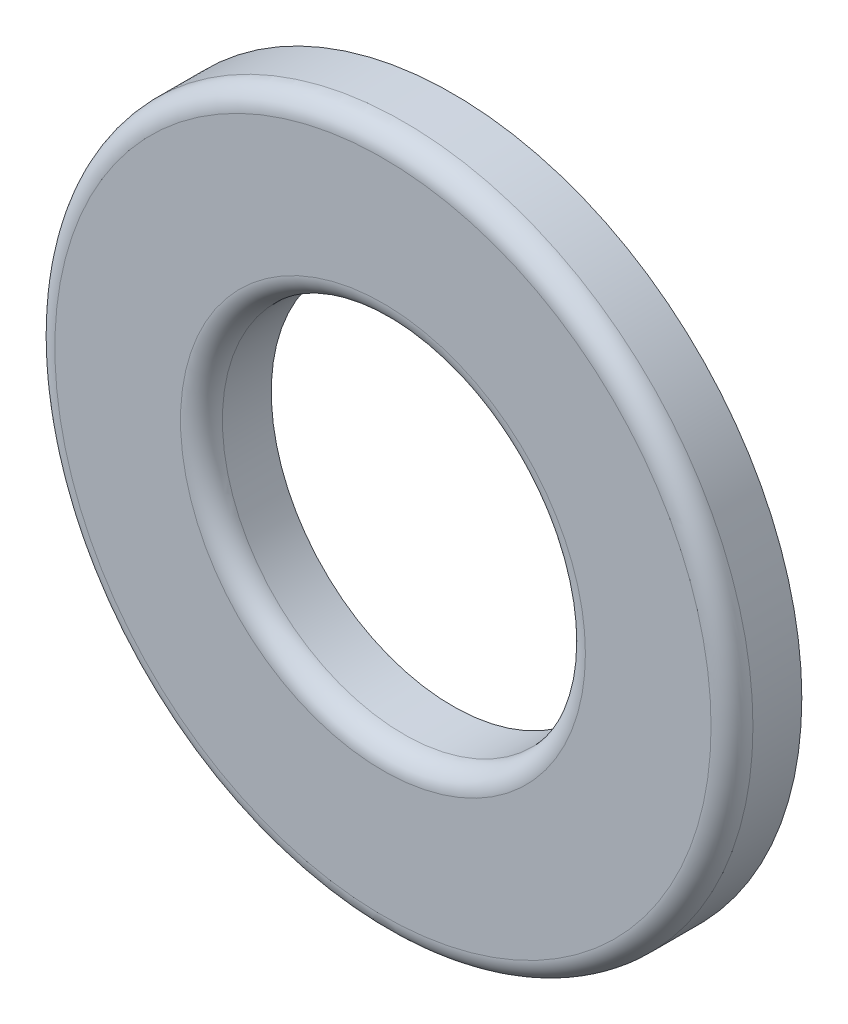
from build123d import *

# Parameters (mm, degrees)
ESQUISSE1_R          = 5
ESQUISSE1_R_2        = 2.6
BASE_EXTRUSION_DEPTH = 1
CONG_1_R             = 0.3


with BuildPart() as part:
    # Esquisse1 → Base-Extrusion (new body)
    with BuildSketch(Plane.XY):
        Circle(ESQUISSE1_R)
        Circle(ESQUISSE1_R_2, mode=Mode.SUBTRACT)
    extrude(amount=BASE_EXTRUSION_DEPTH)

    # Cong_1
    cong_1_edges = [part.edges().sort_by_distance(p)[0] for p in [
        (-5, 0, 1),
        (-2.6, 0, 1),
    ]]
    fillet(cong_1_edges, radius=CONG_1_R)


solid = part.part
